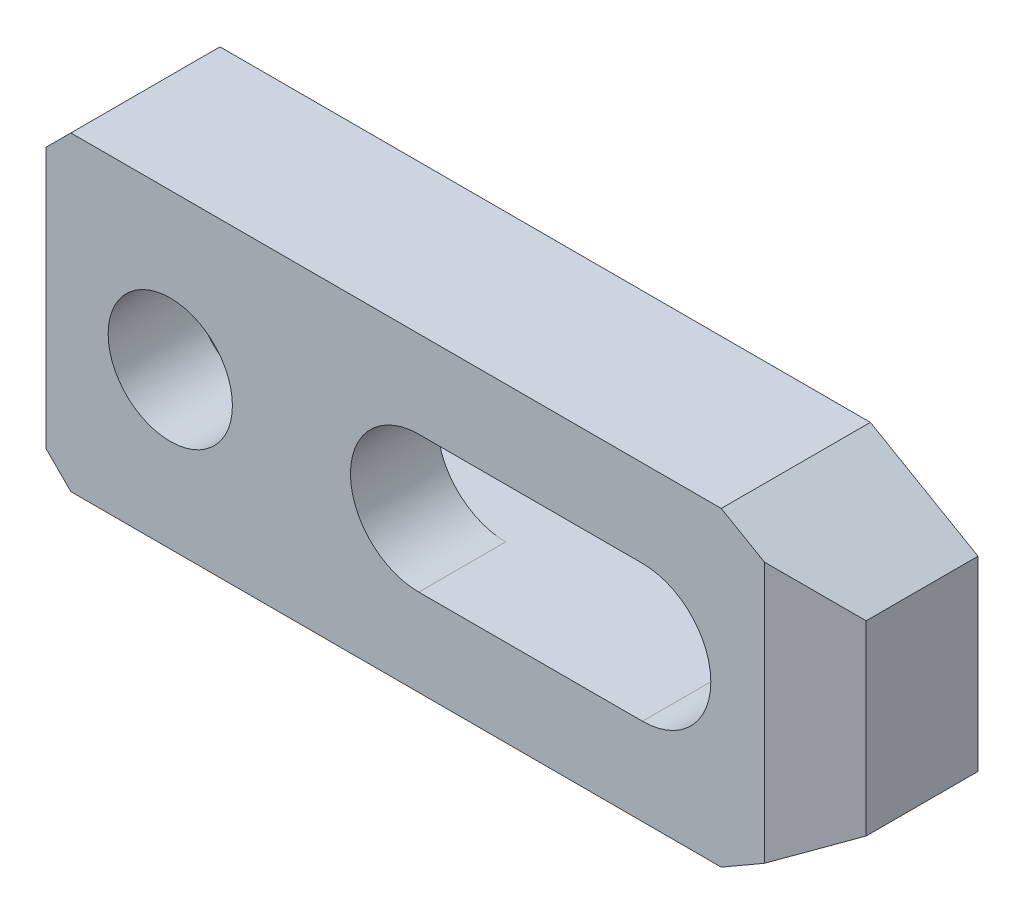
ISO-10303-21;
HEADER;
FILE_DESCRIPTION(('STEP AP214'),'2;1');
FILE_NAME('part.step','',(''),(''),'','','');
FILE_SCHEMA(('AUTOMOTIVE_DESIGN { 1 0 10303 214 1 1 1 1 }'));
ENDSEC;
DATA;
#1=APPLICATION_CONTEXT('core data for automotive mechanical design processes');
#2=APPLICATION_PROTOCOL_DEFINITION('international standard','automotive_design',2000,#1);
#3=PRODUCT_CONTEXT('',#1,'mechanical');
#4=PRODUCT('Part','Part','',(#3));
#5=PRODUCT_RELATED_PRODUCT_CATEGORY('part','',(#4));
#6=PRODUCT_DEFINITION_FORMATION('','',#4);
#7=PRODUCT_DEFINITION_CONTEXT('part definition',#1,'design');
#8=PRODUCT_DEFINITION('design','',#6,#7);
#9=PRODUCT_DEFINITION_SHAPE('','',#8);
#10=(LENGTH_UNIT() NAMED_UNIT(*) SI_UNIT(.MILLI.,.METRE.));
#11=(NAMED_UNIT(*) PLANE_ANGLE_UNIT() SI_UNIT($,.RADIAN.));
#12=(NAMED_UNIT(*) SI_UNIT($,.STERADIAN.) SOLID_ANGLE_UNIT());
#13=UNCERTAINTY_MEASURE_WITH_UNIT(LENGTH_MEASURE(1.E-05),#10,'distance_accuracy_value','');
#14=(GEOMETRIC_REPRESENTATION_CONTEXT(3) GLOBAL_UNCERTAINTY_ASSIGNED_CONTEXT((#13)) GLOBAL_UNIT_ASSIGNED_CONTEXT((#10,
#11,#12)) REPRESENTATION_CONTEXT('',''));
#15=CARTESIAN_POINT('',(0.,0.,0.));
#16=DIRECTION('',(0.,0.,1.));
#17=DIRECTION('',(1.,0.,0.));
#18=AXIS2_PLACEMENT_3D('',#15,#16,#17);
#19=CARTESIAN_POINT('',(-26.8423233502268,31.657676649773,0.));
#20=DIRECTION('',(0.,0.,1.));
#21=DIRECTION('',(-1.,0.,0.));
#22=AXIS2_PLACEMENT_3D('',#19,#20,#21);
#23=PLANE('',#22);
#24=DIRECTION('',(0.,1.,0.));
#25=VECTOR('',#24,1.);
#26=CARTESIAN_POINT('',(-48.,-10.5,0.));
#27=LINE('',#26,#25);
#28=CARTESIAN_POINT('',(-48.,-10.5,0.));
#29=VERTEX_POINT('',#28);
#30=CARTESIAN_POINT('',(-48.,-5.5,0.));
#31=VERTEX_POINT('',#30);
#32=EDGE_CURVE('E147',#29,#31,#27,.T.);
#33=ORIENTED_EDGE('',*,*,#32,.T.);
#34=DIRECTION('',(-1.,0.,0.));
#35=VECTOR('',#34,1.);
#36=CARTESIAN_POINT('',(0.,-5.5,0.));
#37=LINE('',#36,#35);
#38=CARTESIAN_POINT('',(0.,-5.5,0.));
#39=VERTEX_POINT('',#38);
#40=EDGE_CURVE('E237',#39,#31,#37,.T.);
#41=ORIENTED_EDGE('',*,*,#40,.F.);
#42=CARTESIAN_POINT('',(0.,0.,0.));
#43=DIRECTION('',(0.,0.,1.));
#44=DIRECTION('',(-1.,0.,0.));
#45=AXIS2_PLACEMENT_3D('',#42,#43,#44);
#46=CIRCLE('',#45,5.5);
#47=CARTESIAN_POINT('',(0.,5.5,0.));
#48=VERTEX_POINT('',#47);
#49=EDGE_CURVE('E128',#39,#48,#46,.T.);
#50=ORIENTED_EDGE('',*,*,#49,.T.);
#51=DIRECTION('',(1.,0.,0.));
#52=VECTOR('',#51,1.);
#53=CARTESIAN_POINT('',(-18.,5.5,0.));
#54=LINE('',#53,#52);
#55=CARTESIAN_POINT('',(-48.,5.5,0.));
#56=VERTEX_POINT('',#55);
#57=EDGE_CURVE('E119',#56,#48,#54,.T.);
#58=ORIENTED_EDGE('',*,*,#57,.F.);
#59=CARTESIAN_POINT('',(-48.,10.5,0.));
#60=VERTEX_POINT('',#59);
#61=EDGE_CURVE('E124',#56,#60,#27,.T.);
#62=ORIENTED_EDGE('',*,*,#61,.T.);
#63=DIRECTION('',(-0.707106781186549,-0.707106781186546,0.));
#64=VECTOR('',#63,1.);
#65=CARTESIAN_POINT('',(-46.,12.5,0.));
#66=LINE('',#65,#64);
#67=CARTESIAN_POINT('',(-46.,12.5,0.));
#68=VERTEX_POINT('',#67);
#69=EDGE_CURVE('E148',#68,#60,#66,.T.);
#70=ORIENTED_EDGE('',*,*,#69,.F.);
#71=DIRECTION('',(-1.,0.,0.));
#72=VECTOR('',#71,1.);
#73=CARTESIAN_POINT('',(6.3397459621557,12.5,0.));
#74=LINE('',#73,#72);
#75=CARTESIAN_POINT('',(6.3397459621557,12.5,0.));
#76=VERTEX_POINT('',#75);
#77=EDGE_CURVE('E151',#76,#68,#74,.T.);
#78=ORIENTED_EDGE('',*,*,#77,.F.);
#79=DIRECTION('',(-0.866025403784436,0.5,0.));
#80=VECTOR('',#79,1.);
#81=CARTESIAN_POINT('',(15.,7.5,0.));
#82=LINE('',#81,#80);
#83=CARTESIAN_POINT('',(15.,7.5,0.));
#84=VERTEX_POINT('',#83);
#85=EDGE_CURVE('E158',#84,#76,#82,.T.);
#86=ORIENTED_EDGE('',*,*,#85,.F.);
#87=DIRECTION('',(0.,-1.,0.));
#88=VECTOR('',#87,1.);
#89=CARTESIAN_POINT('',(15.,7.5,0.));
#90=LINE('',#89,#88);
#91=CARTESIAN_POINT('',(15.,-7.5,0.));
#92=VERTEX_POINT('',#91);
#93=EDGE_CURVE('E181',#84,#92,#90,.T.);
#94=ORIENTED_EDGE('',*,*,#93,.T.);
#95=DIRECTION('',(-0.86602540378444,-0.5,0.));
#96=VECTOR('',#95,1.);
#97=CARTESIAN_POINT('',(15.,-7.5,0.));
#98=LINE('',#97,#96);
#99=CARTESIAN_POINT('',(6.33974596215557,-12.5,0.));
#100=VERTEX_POINT('',#99);
#101=EDGE_CURVE('E208',#92,#100,#98,.T.);
#102=ORIENTED_EDGE('',*,*,#101,.T.);
#103=DIRECTION('',(-1.,0.,0.));
#104=VECTOR('',#103,1.);
#105=CARTESIAN_POINT('',(6.33974596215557,-12.5,0.));
#106=LINE('',#105,#104);
#107=CARTESIAN_POINT('',(-46.,-12.5,0.));
#108=VERTEX_POINT('',#107);
#109=EDGE_CURVE('E210',#100,#108,#106,.T.);
#110=ORIENTED_EDGE('',*,*,#109,.T.);
#111=DIRECTION('',(-0.70710678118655,0.707106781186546,0.));
#112=VECTOR('',#111,1.);
#113=CARTESIAN_POINT('',(-46.,-12.5,0.));
#114=LINE('',#113,#112);
#115=EDGE_CURVE('E150',#108,#29,#114,.T.);
#116=ORIENTED_EDGE('',*,*,#115,.T.);
#117=EDGE_LOOP('',(#33,#41,#50,#58,#62,#70,#78,#86,#94,#102,#110,#116));
#118=FACE_BOUND('',#117,.T.);
#119=ADVANCED_FACE('F14',(#118),#23,.F.);
#120=CARTESIAN_POINT('',(-48.,-10.5,12.));
#121=DIRECTION('',(-1.,0.,0.));
#122=DIRECTION('',(0.,0.,-1.));
#123=AXIS2_PLACEMENT_3D('',#120,#121,#122);
#124=PLANE('',#123);
#125=DIRECTION('',(0.,-1.,0.));
#126=VECTOR('',#125,1.);
#127=CARTESIAN_POINT('',(-48.,-10.5,5.));
#128=LINE('',#127,#126);
#129=CARTESIAN_POINT('',(-48.,5.5,5.));
#130=VERTEX_POINT('',#129);
#131=CARTESIAN_POINT('',(-48.,-5.5,5.));
#132=VERTEX_POINT('',#131);
#133=EDGE_CURVE('E141',#130,#132,#128,.T.);
#134=ORIENTED_EDGE('',*,*,#133,.T.);
#135=DIRECTION('',(0.,0.,-1.));
#136=VECTOR('',#135,1.);
#137=CARTESIAN_POINT('',(-48.,-5.5,12.));
#138=LINE('',#137,#136);
#139=EDGE_CURVE('E140',#132,#31,#138,.T.);
#140=ORIENTED_EDGE('',*,*,#139,.T.);
#141=ORIENTED_EDGE('',*,*,#32,.F.);
#142=DIRECTION('',(0.,0.,-1.));
#143=VECTOR('',#142,1.);
#144=CARTESIAN_POINT('',(-48.,-10.5,12.));
#145=LINE('',#144,#143);
#146=CARTESIAN_POINT('',(-48.,-10.5,12.));
#147=VERTEX_POINT('',#146);
#148=EDGE_CURVE('E189',#147,#29,#145,.T.);
#149=ORIENTED_EDGE('',*,*,#148,.F.);
#150=DIRECTION('',(0.,1.,0.));
#151=VECTOR('',#150,1.);
#152=CARTESIAN_POINT('',(-48.,-10.5,12.));
#153=LINE('',#152,#151);
#154=CARTESIAN_POINT('',(-48.,10.5,12.));
#155=VERTEX_POINT('',#154);
#156=EDGE_CURVE('E171',#147,#155,#153,.T.);
#157=ORIENTED_EDGE('',*,*,#156,.T.);
#158=DIRECTION('',(0.,0.,-1.));
#159=VECTOR('',#158,1.);
#160=CARTESIAN_POINT('',(-48.,10.5,12.));
#161=LINE('',#160,#159);
#162=EDGE_CURVE('E145',#155,#60,#161,.T.);
#163=ORIENTED_EDGE('',*,*,#162,.T.);
#164=ORIENTED_EDGE('',*,*,#61,.F.);
#165=DIRECTION('',(0.,0.,-1.));
#166=VECTOR('',#165,1.);
#167=CARTESIAN_POINT('',(-48.,5.5,12.));
#168=LINE('',#167,#166);
#169=EDGE_CURVE('E135',#130,#56,#168,.T.);
#170=ORIENTED_EDGE('',*,*,#169,.F.);
#171=EDGE_LOOP('',(#134,#140,#141,#149,#157,#163,#164,#170));
#172=FACE_BOUND('',#171,.T.);
#173=ADVANCED_FACE('F143',(#172),#124,.T.);
#174=CARTESIAN_POINT('',(-38.,0.,12.));
#175=DIRECTION('',(0.,0.,-1.));
#176=DIRECTION('',(1.,0.,0.));
#177=AXIS2_PLACEMENT_3D('',#174,#175,#176);
#178=CYLINDRICAL_SURFACE('',#177,5.);
#179=CARTESIAN_POINT('',(-38.,0.,12.));
#180=DIRECTION('',(0.,0.,1.));
#181=DIRECTION('',(-1.,0.,0.));
#182=AXIS2_PLACEMENT_3D('',#179,#180,#181);
#183=CIRCLE('',#182,5.);
#184=CARTESIAN_POINT('',(-43.,0.,12.));
#185=VERTEX_POINT('',#184);
#186=EDGE_CURVE('E161',#185,#185,#183,.T.);
#187=ORIENTED_EDGE('',*,*,#186,.T.);
#188=EDGE_LOOP('',(#187));
#189=FACE_BOUND('',#188,.T.);
#190=CARTESIAN_POINT('',(-38.,0.,5.));
#191=DIRECTION('',(0.,0.,-1.));
#192=DIRECTION('',(1.,0.,0.));
#193=AXIS2_PLACEMENT_3D('',#190,#191,#192);
#194=CIRCLE('',#193,5.);
#195=CARTESIAN_POINT('',(-33.,0.,5.));
#196=VERTEX_POINT('',#195);
#197=EDGE_CURVE('E425',#196,#196,#194,.T.);
#198=ORIENTED_EDGE('',*,*,#197,.T.);
#199=EDGE_LOOP('',(#198));
#200=FACE_BOUND('',#199,.T.);
#201=ADVANCED_FACE('F262',(#189,#200),#178,.F.);
#202=CARTESIAN_POINT('',(-18.,0.,12.));
#203=DIRECTION('',(0.,0.,-1.));
#204=DIRECTION('',(1.,0.,0.));
#205=AXIS2_PLACEMENT_3D('',#202,#203,#204);
#206=CYLINDRICAL_SURFACE('',#205,5.5);
#207=DIRECTION('',(0.,0.,-1.));
#208=VECTOR('',#207,1.);
#209=CARTESIAN_POINT('',(-18.,-5.5,12.));
#210=LINE('',#209,#208);
#211=CARTESIAN_POINT('',(-18.,-5.5,12.));
#212=VERTEX_POINT('',#211);
#213=CARTESIAN_POINT('',(-18.,-5.5,5.));
#214=VERTEX_POINT('',#213);
#215=EDGE_CURVE('E256',#212,#214,#210,.T.);
#216=ORIENTED_EDGE('',*,*,#215,.T.);
#217=CARTESIAN_POINT('',(-18.,0.,5.));
#218=DIRECTION('',(0.,0.,-1.));
#219=DIRECTION('',(1.,0.,0.));
#220=AXIS2_PLACEMENT_3D('',#217,#218,#219);
#221=CIRCLE('',#220,5.5);
#222=CARTESIAN_POINT('',(-18.,5.5,5.));
#223=VERTEX_POINT('',#222);
#224=EDGE_CURVE('E278',#214,#223,#221,.T.);
#225=ORIENTED_EDGE('',*,*,#224,.T.);
#226=DIRECTION('',(0.,0.,-1.));
#227=VECTOR('',#226,1.);
#228=CARTESIAN_POINT('',(-18.,5.5,12.));
#229=LINE('',#228,#227);
#230=CARTESIAN_POINT('',(-18.,5.5,12.));
#231=VERTEX_POINT('',#230);
#232=EDGE_CURVE('E244',#231,#223,#229,.T.);
#233=ORIENTED_EDGE('',*,*,#232,.F.);
#234=CARTESIAN_POINT('',(-18.,0.,12.));
#235=DIRECTION('',(0.,0.,1.));
#236=DIRECTION('',(-1.,0.,0.));
#237=AXIS2_PLACEMENT_3D('',#234,#235,#236);
#238=CIRCLE('',#237,5.5);
#239=EDGE_CURVE('E132',#231,#212,#238,.T.);
#240=ORIENTED_EDGE('',*,*,#239,.T.);
#241=EDGE_LOOP('',(#216,#225,#233,#240));
#242=FACE_BOUND('',#241,.T.);
#243=ADVANCED_FACE('F269',(#242),#206,.F.);
#244=CARTESIAN_POINT('',(-26.8423233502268,31.657676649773,12.));
#245=DIRECTION('',(0.,0.,1.));
#246=DIRECTION('',(-1.,0.,0.));
#247=AXIS2_PLACEMENT_3D('',#244,#245,#246);
#248=PLANE('',#247);
#249=DIRECTION('',(0.,-1.,0.));
#250=VECTOR('',#249,1.);
#251=CARTESIAN_POINT('',(9.80384757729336,31.657676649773,12.));
#252=LINE('',#251,#250);
#253=CARTESIAN_POINT('',(9.80384757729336,10.5,12.));
#254=VERTEX_POINT('',#253);
#255=CARTESIAN_POINT('',(9.80384757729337,-10.5,12.));
#256=VERTEX_POINT('',#255);
#257=EDGE_CURVE('E233',#254,#256,#252,.T.);
#258=ORIENTED_EDGE('',*,*,#257,.F.);
#259=DIRECTION('',(-0.866025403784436,0.5,0.));
#260=VECTOR('',#259,1.);
#261=CARTESIAN_POINT('',(15.,7.5,12.));
#262=LINE('',#261,#260);
#263=CARTESIAN_POINT('',(6.3397459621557,12.5,12.));
#264=VERTEX_POINT('',#263);
#265=EDGE_CURVE('E179',#254,#264,#262,.T.);
#266=ORIENTED_EDGE('',*,*,#265,.T.);
#267=DIRECTION('',(-1.,0.,0.));
#268=VECTOR('',#267,1.);
#269=CARTESIAN_POINT('',(6.3397459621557,12.5,12.));
#270=LINE('',#269,#268);
#271=CARTESIAN_POINT('',(-46.,12.5,12.));
#272=VERTEX_POINT('',#271);
#273=EDGE_CURVE('E176',#264,#272,#270,.T.);
#274=ORIENTED_EDGE('',*,*,#273,.T.);
#275=DIRECTION('',(-0.707106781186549,-0.707106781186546,0.));
#276=VECTOR('',#275,1.);
#277=CARTESIAN_POINT('',(-46.,12.5,12.));
#278=LINE('',#277,#276);
#279=EDGE_CURVE('E173',#272,#155,#278,.T.);
#280=ORIENTED_EDGE('',*,*,#279,.T.);
#281=ORIENTED_EDGE('',*,*,#156,.F.);
#282=DIRECTION('',(-0.70710678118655,0.707106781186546,0.));
#283=VECTOR('',#282,1.);
#284=CARTESIAN_POINT('',(-46.,-12.5,12.));
#285=LINE('',#284,#283);
#286=CARTESIAN_POINT('',(-46.,-12.5,12.));
#287=VERTEX_POINT('',#286);
#288=EDGE_CURVE('E168',#287,#147,#285,.T.);
#289=ORIENTED_EDGE('',*,*,#288,.F.);
#290=DIRECTION('',(-1.,0.,0.));
#291=VECTOR('',#290,1.);
#292=CARTESIAN_POINT('',(6.33974596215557,-12.5,12.));
#293=LINE('',#292,#291);
#294=CARTESIAN_POINT('',(6.33974596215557,-12.5,12.));
#295=VERTEX_POINT('',#294);
#296=EDGE_CURVE('E165',#295,#287,#293,.T.);
#297=ORIENTED_EDGE('',*,*,#296,.F.);
#298=DIRECTION('',(-0.86602540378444,-0.5,0.));
#299=VECTOR('',#298,1.);
#300=CARTESIAN_POINT('',(15.,-7.5,12.));
#301=LINE('',#300,#299);
#302=EDGE_CURVE('E162',#256,#295,#301,.T.);
#303=ORIENTED_EDGE('',*,*,#302,.F.);
#304=EDGE_LOOP('',(#258,#266,#274,#280,#281,#289,#297,#303));
#305=FACE_BOUND('',#304,.T.);
#306=ORIENTED_EDGE('',*,*,#186,.F.);
#307=EDGE_LOOP('',(#306));
#308=FACE_BOUND('',#307,.T.);
#309=DIRECTION('',(-1.,0.,0.));
#310=VECTOR('',#309,1.);
#311=CARTESIAN_POINT('',(0.,-5.5,12.));
#312=LINE('',#311,#310);
#313=CARTESIAN_POINT('',(0.,-5.5,12.));
#314=VERTEX_POINT('',#313);
#315=EDGE_CURVE('E247',#314,#212,#312,.T.);
#316=ORIENTED_EDGE('',*,*,#315,.T.);
#317=ORIENTED_EDGE('',*,*,#239,.F.);
#318=DIRECTION('',(1.,0.,0.));
#319=VECTOR('',#318,1.);
#320=CARTESIAN_POINT('',(-18.,5.5,12.));
#321=LINE('',#320,#319);
#322=CARTESIAN_POINT('',(0.,5.5,12.));
#323=VERTEX_POINT('',#322);
#324=EDGE_CURVE('E241',#231,#323,#321,.T.);
#325=ORIENTED_EDGE('',*,*,#324,.T.);
#326=CARTESIAN_POINT('',(0.,0.,12.));
#327=DIRECTION('',(0.,0.,1.));
#328=DIRECTION('',(-1.,0.,0.));
#329=AXIS2_PLACEMENT_3D('',#326,#327,#328);
#330=CIRCLE('',#329,5.5);
#331=EDGE_CURVE('E245',#314,#323,#330,.T.);
#332=ORIENTED_EDGE('',*,*,#331,.F.);
#333=EDGE_LOOP('',(#316,#317,#325,#332));
#334=FACE_BOUND('',#333,.T.);
#335=ADVANCED_FACE('F265',(#305,#308,#334),#248,.T.);
#336=CARTESIAN_POINT('',(15.,7.5,12.));
#337=DIRECTION('',(-0.5,-0.866025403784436,0.));
#338=DIRECTION('',(0.866025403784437,-0.5,0.));
#339=AXIS2_PLACEMENT_3D('',#336,#337,#338);
#340=PLANE('',#339);
#341=ORIENTED_EDGE('',*,*,#265,.F.);
#342=DIRECTION('',(0.774596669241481,-0.447213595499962,-0.447213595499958));
#343=VECTOR('',#342,1.);
#344=CARTESIAN_POINT('',(13.9607695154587,8.1,9.6));
#345=LINE('',#344,#343);
#346=CARTESIAN_POINT('',(15.,7.5,9.));
#347=VERTEX_POINT('',#346);
#348=EDGE_CURVE('E235',#254,#347,#345,.T.);
#349=ORIENTED_EDGE('',*,*,#348,.T.);
#350=DIRECTION('',(0.,0.,-1.));
#351=VECTOR('',#350,1.);
#352=CARTESIAN_POINT('',(15.,7.5,12.));
#353=LINE('',#352,#351);
#354=EDGE_CURVE('E164',#347,#84,#353,.T.);
#355=ORIENTED_EDGE('',*,*,#354,.T.);
#356=ORIENTED_EDGE('',*,*,#85,.T.);
#357=DIRECTION('',(0.,0.,-1.));
#358=VECTOR('',#357,1.);
#359=CARTESIAN_POINT('',(6.3397459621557,12.5,12.));
#360=LINE('',#359,#358);
#361=EDGE_CURVE('E9',#264,#76,#360,.T.);
#362=ORIENTED_EDGE('',*,*,#361,.F.);
#363=EDGE_LOOP('',(#341,#349,#355,#356,#362));
#364=FACE_BOUND('',#363,.T.);
#365=ADVANCED_FACE('F268',(#364),#340,.F.);
#366=CARTESIAN_POINT('',(6.3397459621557,12.5,12.));
#367=DIRECTION('',(0.,-1.,0.));
#368=DIRECTION('',(0.,0.,1.));
#369=AXIS2_PLACEMENT_3D('',#366,#367,#368);
#370=PLANE('',#369);
#371=DIRECTION('',(0.,0.,-1.));
#372=VECTOR('',#371,1.);
#373=CARTESIAN_POINT('',(-46.,12.5,12.));
#374=LINE('',#373,#372);
#375=EDGE_CURVE('E22',#272,#68,#374,.T.);
#376=ORIENTED_EDGE('',*,*,#375,.F.);
#377=ORIENTED_EDGE('',*,*,#273,.F.);
#378=ORIENTED_EDGE('',*,*,#361,.T.);
#379=ORIENTED_EDGE('',*,*,#77,.T.);
#380=EDGE_LOOP('',(#376,#377,#378,#379));
#381=FACE_BOUND('',#380,.T.);
#382=ADVANCED_FACE('F16',(#381),#370,.F.);
#383=CARTESIAN_POINT('',(-46.,12.5,12.));
#384=DIRECTION('',(0.707106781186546,-0.707106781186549,0.));
#385=DIRECTION('',(0.707106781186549,0.707106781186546,0.));
#386=AXIS2_PLACEMENT_3D('',#383,#384,#385);
#387=PLANE('',#386);
#388=ORIENTED_EDGE('',*,*,#162,.F.);
#389=ORIENTED_EDGE('',*,*,#279,.F.);
#390=ORIENTED_EDGE('',*,*,#375,.T.);
#391=ORIENTED_EDGE('',*,*,#69,.T.);
#392=EDGE_LOOP('',(#388,#389,#390,#391));
#393=FACE_BOUND('',#392,.T.);
#394=ADVANCED_FACE('F193',(#393),#387,.F.);
#395=CARTESIAN_POINT('',(-46.,-12.5,12.));
#396=DIRECTION('',(-0.707106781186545,-0.70710678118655,0.));
#397=DIRECTION('',(0.70710678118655,-0.707106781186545,0.));
#398=AXIS2_PLACEMENT_3D('',#395,#396,#397);
#399=PLANE('',#398);
#400=DIRECTION('',(0.,0.,-1.));
#401=VECTOR('',#400,1.);
#402=CARTESIAN_POINT('',(-46.,-12.5,12.));
#403=LINE('',#402,#401);
#404=EDGE_CURVE('E187',#287,#108,#403,.T.);
#405=ORIENTED_EDGE('',*,*,#404,.F.);
#406=ORIENTED_EDGE('',*,*,#288,.T.);
#407=ORIENTED_EDGE('',*,*,#148,.T.);
#408=ORIENTED_EDGE('',*,*,#115,.F.);
#409=EDGE_LOOP('',(#405,#406,#407,#408));
#410=FACE_BOUND('',#409,.T.);
#411=ADVANCED_FACE('F220',(#410),#399,.T.);
#412=CARTESIAN_POINT('',(6.33974596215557,-12.5,12.));
#413=DIRECTION('',(0.,-1.,0.));
#414=DIRECTION('',(1.,0.,0.));
#415=AXIS2_PLACEMENT_3D('',#412,#413,#414);
#416=PLANE('',#415);
#417=DIRECTION('',(0.,0.,-1.));
#418=VECTOR('',#417,1.);
#419=CARTESIAN_POINT('',(6.33974596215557,-12.5,12.));
#420=LINE('',#419,#418);
#421=EDGE_CURVE('E185',#295,#100,#420,.T.);
#422=ORIENTED_EDGE('',*,*,#421,.F.);
#423=ORIENTED_EDGE('',*,*,#296,.T.);
#424=ORIENTED_EDGE('',*,*,#404,.T.);
#425=ORIENTED_EDGE('',*,*,#109,.F.);
#426=EDGE_LOOP('',(#422,#423,#424,#425));
#427=FACE_BOUND('',#426,.T.);
#428=ADVANCED_FACE('F306',(#427),#416,.T.);
#429=CARTESIAN_POINT('',(15.,-7.5,12.));
#430=DIRECTION('',(0.5,-0.86602540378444,0.));
#431=DIRECTION('',(0.86602540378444,0.5,0.));
#432=AXIS2_PLACEMENT_3D('',#429,#430,#431);
#433=PLANE('',#432);
#434=DIRECTION('',(0.774596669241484,0.447213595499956,-0.44721359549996));
#435=VECTOR('',#434,1.);
#436=CARTESIAN_POINT('',(13.9607695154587,-8.1,9.6));
#437=LINE('',#436,#435);
#438=CARTESIAN_POINT('',(15.,-7.5,9.));
#439=VERTEX_POINT('',#438);
#440=EDGE_CURVE('E37',#256,#439,#437,.T.);
#441=ORIENTED_EDGE('',*,*,#440,.F.);
#442=ORIENTED_EDGE('',*,*,#302,.T.);
#443=ORIENTED_EDGE('',*,*,#421,.T.);
#444=ORIENTED_EDGE('',*,*,#101,.F.);
#445=DIRECTION('',(0.,0.,-1.));
#446=VECTOR('',#445,1.);
#447=CARTESIAN_POINT('',(15.,-7.5,12.));
#448=LINE('',#447,#446);
#449=EDGE_CURVE('E183',#439,#92,#448,.T.);
#450=ORIENTED_EDGE('',*,*,#449,.F.);
#451=EDGE_LOOP('',(#441,#442,#443,#444,#450));
#452=FACE_BOUND('',#451,.T.);
#453=ADVANCED_FACE('F303',(#452),#433,.T.);
#454=CARTESIAN_POINT('',(15.,7.5,12.));
#455=DIRECTION('',(1.,0.,0.));
#456=DIRECTION('',(0.,0.,1.));
#457=AXIS2_PLACEMENT_3D('',#454,#455,#456);
#458=PLANE('',#457);
#459=DIRECTION('',(0.,-1.,0.));
#460=VECTOR('',#459,1.);
#461=CARTESIAN_POINT('',(15.,20.,9.));
#462=LINE('',#461,#460);
#463=EDGE_CURVE('E227',#347,#439,#462,.T.);
#464=ORIENTED_EDGE('',*,*,#463,.T.);
#465=ORIENTED_EDGE('',*,*,#449,.T.);
#466=ORIENTED_EDGE('',*,*,#93,.F.);
#467=ORIENTED_EDGE('',*,*,#354,.F.);
#468=EDGE_LOOP('',(#464,#465,#466,#467));
#469=FACE_BOUND('',#468,.T.);
#470=ADVANCED_FACE('F205',(#469),#458,.T.);
#471=CARTESIAN_POINT('',(0.,-5.5,12.));
#472=DIRECTION('',(0.,-1.,0.));
#473=DIRECTION('',(1.,0.,0.));
#474=AXIS2_PLACEMENT_3D('',#471,#472,#473);
#475=PLANE('',#474);
#476=ORIENTED_EDGE('',*,*,#40,.T.);
#477=ORIENTED_EDGE('',*,*,#139,.F.);
#478=DIRECTION('',(1.,0.,0.));
#479=VECTOR('',#478,1.);
#480=CARTESIAN_POINT('',(-55.,-5.5,5.));
#481=LINE('',#480,#479);
#482=EDGE_CURVE('E276',#132,#214,#481,.T.);
#483=ORIENTED_EDGE('',*,*,#482,.T.);
#484=ORIENTED_EDGE('',*,*,#215,.F.);
#485=ORIENTED_EDGE('',*,*,#315,.F.);
#486=DIRECTION('',(0.,0.,-1.));
#487=VECTOR('',#486,1.);
#488=CARTESIAN_POINT('',(0.,-5.5,12.));
#489=LINE('',#488,#487);
#490=EDGE_CURVE('E255',#314,#39,#489,.T.);
#491=ORIENTED_EDGE('',*,*,#490,.T.);
#492=EDGE_LOOP('',(#476,#477,#483,#484,#485,#491));
#493=FACE_BOUND('',#492,.T.);
#494=ADVANCED_FACE('F275',(#493),#475,.F.);
#495=CARTESIAN_POINT('',(0.,0.,12.));
#496=DIRECTION('',(0.,0.,-1.));
#497=DIRECTION('',(1.,0.,0.));
#498=AXIS2_PLACEMENT_3D('',#495,#496,#497);
#499=CYLINDRICAL_SURFACE('',#498,5.5);
#500=DIRECTION('',(0.,0.,-1.));
#501=VECTOR('',#500,1.);
#502=CARTESIAN_POINT('',(0.,5.5,12.));
#503=LINE('',#502,#501);
#504=EDGE_CURVE('E253',#323,#48,#503,.T.);
#505=ORIENTED_EDGE('',*,*,#504,.T.);
#506=ORIENTED_EDGE('',*,*,#49,.F.);
#507=ORIENTED_EDGE('',*,*,#490,.F.);
#508=ORIENTED_EDGE('',*,*,#331,.T.);
#509=EDGE_LOOP('',(#505,#506,#507,#508));
#510=FACE_BOUND('',#509,.T.);
#511=ADVANCED_FACE('F280',(#510),#499,.F.);
#512=CARTESIAN_POINT('',(-18.,5.5,12.));
#513=DIRECTION('',(0.,1.,0.));
#514=DIRECTION('',(-1.,0.,0.));
#515=AXIS2_PLACEMENT_3D('',#512,#513,#514);
#516=PLANE('',#515);
#517=ORIENTED_EDGE('',*,*,#57,.T.);
#518=ORIENTED_EDGE('',*,*,#504,.F.);
#519=ORIENTED_EDGE('',*,*,#324,.F.);
#520=ORIENTED_EDGE('',*,*,#232,.T.);
#521=DIRECTION('',(1.,0.,0.));
#522=VECTOR('',#521,1.);
#523=CARTESIAN_POINT('',(-55.,5.5,5.));
#524=LINE('',#523,#522);
#525=EDGE_CURVE('E29',#130,#223,#524,.T.);
#526=ORIENTED_EDGE('',*,*,#525,.F.);
#527=ORIENTED_EDGE('',*,*,#169,.T.);
#528=EDGE_LOOP('',(#517,#518,#519,#520,#526,#527));
#529=FACE_BOUND('',#528,.T.);
#530=ADVANCED_FACE('F136',(#529),#516,.F.);
#531=CARTESIAN_POINT('',(2.875644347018,20.,16.));
#532=DIRECTION('',(-0.5,0.,-0.866025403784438));
#533=DIRECTION('',(0.866025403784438,0.,-0.5));
#534=AXIS2_PLACEMENT_3D('',#531,#532,#533);
#535=PLANE('',#534);
#536=ORIENTED_EDGE('',*,*,#257,.T.);
#537=ORIENTED_EDGE('',*,*,#440,.T.);
#538=ORIENTED_EDGE('',*,*,#463,.F.);
#539=ORIENTED_EDGE('',*,*,#348,.F.);
#540=EDGE_LOOP('',(#536,#537,#538,#539));
#541=FACE_BOUND('',#540,.T.);
#542=ADVANCED_FACE('F288',(#541),#535,.F.);
#543=CARTESIAN_POINT('',(-55.,5.5,5.));
#544=DIRECTION('',(0.,0.,-1.));
#545=DIRECTION('',(1.,0.,0.));
#546=AXIS2_PLACEMENT_3D('',#543,#544,#545);
#547=PLANE('',#546);
#548=ORIENTED_EDGE('',*,*,#197,.F.);
#549=EDGE_LOOP('',(#548));
#550=FACE_BOUND('',#549,.T.);
#551=ORIENTED_EDGE('',*,*,#525,.T.);
#552=ORIENTED_EDGE('',*,*,#224,.F.);
#553=ORIENTED_EDGE('',*,*,#482,.F.);
#554=ORIENTED_EDGE('',*,*,#133,.F.);
#555=EDGE_LOOP('',(#551,#552,#553,#554));
#556=FACE_BOUND('',#555,.T.);
#557=ADVANCED_FACE('F410',(#550,#556),#547,.T.);
#558=CLOSED_SHELL('',(#119,#173,#201,#243,#335,#365,#382,#394,#411,#428,#453,#470,#494,#511,
#530,#542,#557));
#559=MANIFOLD_SOLID_BREP('B1',#558);
#560=ADVANCED_BREP_SHAPE_REPRESENTATION('',(#18,#559),#14);
#561=SHAPE_DEFINITION_REPRESENTATION(#9,#560);
ENDSEC;
END-ISO-10303-21;
